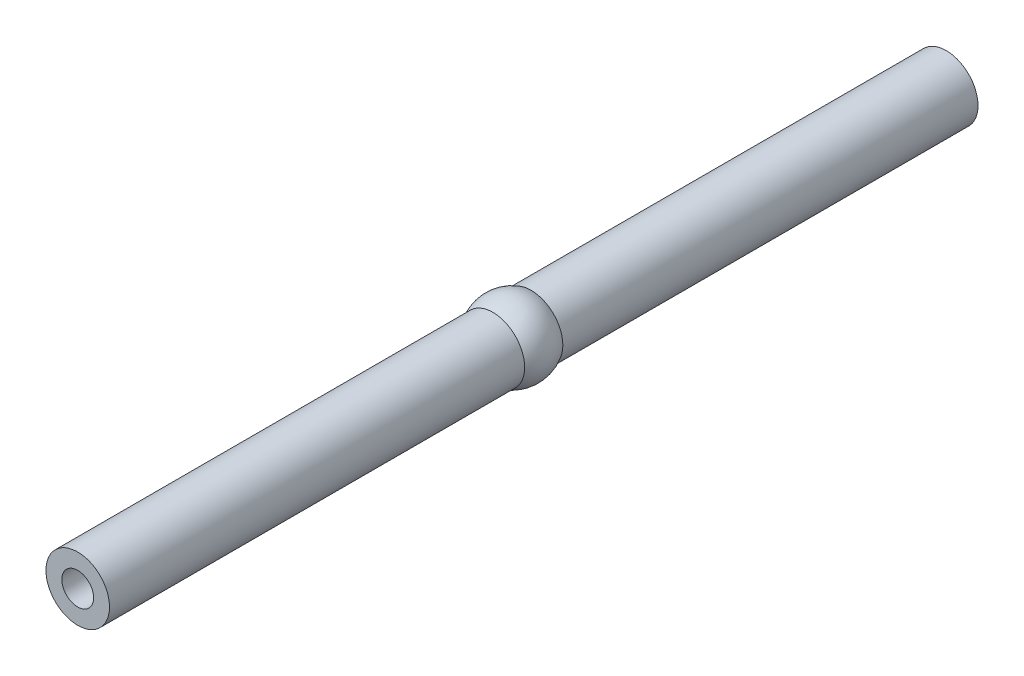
ISO-10303-21;
HEADER;
FILE_DESCRIPTION(('STEP AP214'),'2;1');
FILE_NAME('part.step','',(''),(''),'','','');
FILE_SCHEMA(('AUTOMOTIVE_DESIGN { 1 0 10303 214 1 1 1 1 }'));
ENDSEC;
DATA;
#1=APPLICATION_CONTEXT('core data for automotive mechanical design processes');
#2=APPLICATION_PROTOCOL_DEFINITION('international standard','automotive_design',2000,#1);
#3=PRODUCT_CONTEXT('',#1,'mechanical');
#4=PRODUCT('Part','Part','',(#3));
#5=PRODUCT_RELATED_PRODUCT_CATEGORY('part','',(#4));
#6=PRODUCT_DEFINITION_FORMATION('','',#4);
#7=PRODUCT_DEFINITION_CONTEXT('part definition',#1,'design');
#8=PRODUCT_DEFINITION('design','',#6,#7);
#9=PRODUCT_DEFINITION_SHAPE('','',#8);
#10=(LENGTH_UNIT() NAMED_UNIT(*) SI_UNIT(.MILLI.,.METRE.));
#11=(NAMED_UNIT(*) PLANE_ANGLE_UNIT() SI_UNIT($,.RADIAN.));
#12=(NAMED_UNIT(*) SI_UNIT($,.STERADIAN.) SOLID_ANGLE_UNIT());
#13=UNCERTAINTY_MEASURE_WITH_UNIT(LENGTH_MEASURE(1.E-05),#10,'distance_accuracy_value','');
#14=(GEOMETRIC_REPRESENTATION_CONTEXT(3) GLOBAL_UNCERTAINTY_ASSIGNED_CONTEXT((#13)) GLOBAL_UNIT_ASSIGNED_CONTEXT((#10,
#11,#12)) REPRESENTATION_CONTEXT('',''));
#15=CARTESIAN_POINT('',(0.,0.,0.));
#16=DIRECTION('',(0.,0.,1.));
#17=DIRECTION('',(1.,0.,0.));
#18=AXIS2_PLACEMENT_3D('',#15,#16,#17);
#19=CARTESIAN_POINT('',(0.,0.,41.));
#20=DIRECTION('',(0.,0.,-1.));
#21=DIRECTION('',(-1.,0.,0.));
#22=AXIS2_PLACEMENT_3D('',#19,#20,#21);
#23=CYLINDRICAL_SURFACE('',#22,3.);
#24=CARTESIAN_POINT('',(0.,0.,-1.802775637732));
#25=DIRECTION('',(0.,0.,1.));
#26=DIRECTION('',(1.,0.,0.));
#27=AXIS2_PLACEMENT_3D('',#24,#25,#26);
#28=CIRCLE('',#27,3.);
#29=CARTESIAN_POINT('',(3.,0.,-1.802775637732));
#30=VERTEX_POINT('',#29);
#31=EDGE_CURVE('E35',#30,#30,#28,.F.);
#32=ORIENTED_EDGE('',*,*,#31,.T.);
#33=EDGE_LOOP('',(#32));
#34=FACE_BOUND('',#33,.T.);
#35=CARTESIAN_POINT('',(0.,0.,-41.));
#36=DIRECTION('',(0.,0.,1.));
#37=DIRECTION('',(1.,0.,0.));
#38=AXIS2_PLACEMENT_3D('',#35,#36,#37);
#39=CIRCLE('',#38,3.);
#40=CARTESIAN_POINT('',(3.,0.,-41.));
#41=VERTEX_POINT('',#40);
#42=EDGE_CURVE('E39',#41,#41,#39,.T.);
#43=ORIENTED_EDGE('',*,*,#42,.T.);
#44=EDGE_LOOP('',(#43));
#45=FACE_BOUND('',#44,.T.);
#46=ADVANCED_FACE('F31',(#34,#45),#23,.T.);
#47=CARTESIAN_POINT('',(0.,0.,-41.));
#48=DIRECTION('',(0.,0.,1.));
#49=DIRECTION('',(1.,0.,0.));
#50=AXIS2_PLACEMENT_3D('',#47,#48,#49);
#51=PLANE('',#50);
#52=ORIENTED_EDGE('',*,*,#42,.F.);
#53=EDGE_LOOP('',(#52));
#54=FACE_BOUND('',#53,.T.);
#55=CARTESIAN_POINT('',(0.,0.,-41.));
#56=DIRECTION('',(0.,0.,1.));
#57=DIRECTION('',(1.,0.,0.));
#58=AXIS2_PLACEMENT_3D('',#55,#56,#57);
#59=CIRCLE('',#58,1.5);
#60=CARTESIAN_POINT('',(1.5,0.,-41.));
#61=VERTEX_POINT('',#60);
#62=EDGE_CURVE('E52',#61,#61,#59,.T.);
#63=ORIENTED_EDGE('',*,*,#62,.T.);
#64=EDGE_LOOP('',(#63));
#65=FACE_BOUND('',#64,.T.);
#66=ADVANCED_FACE('F83',(#54,#65),#51,.F.);
#67=CARTESIAN_POINT('',(0.,0.,-31.));
#68=DIRECTION('',(0.,0.,-1.));
#69=DIRECTION('',(-1.,0.,0.));
#70=AXIS2_PLACEMENT_3D('',#67,#68,#69);
#71=CYLINDRICAL_SURFACE('',#70,1.5);
#72=CARTESIAN_POINT('',(0.,0.,-31.));
#73=DIRECTION('',(0.,0.,1.));
#74=DIRECTION('',(1.,0.,0.));
#75=AXIS2_PLACEMENT_3D('',#72,#73,#74);
#76=CIRCLE('',#75,1.5);
#77=CARTESIAN_POINT('',(1.5,0.,-31.));
#78=VERTEX_POINT('',#77);
#79=EDGE_CURVE('E56',#78,#78,#76,.T.);
#80=ORIENTED_EDGE('',*,*,#79,.T.);
#81=EDGE_LOOP('',(#80));
#82=FACE_BOUND('',#81,.T.);
#83=ORIENTED_EDGE('',*,*,#62,.F.);
#84=EDGE_LOOP('',(#83));
#85=FACE_BOUND('',#84,.T.);
#86=ADVANCED_FACE('F87',(#82,#85),#71,.F.);
#87=CARTESIAN_POINT('',(0.,0.,-31.));
#88=DIRECTION('',(0.,0.,-1.));
#89=DIRECTION('',(1.,0.,0.));
#90=AXIS2_PLACEMENT_3D('',#87,#88,#89);
#91=PLANE('',#90);
#92=ORIENTED_EDGE('',*,*,#79,.F.);
#93=EDGE_LOOP('',(#92));
#94=FACE_BOUND('',#93,.T.);
#95=ADVANCED_FACE('F94',(#94),#91,.T.);
#96=CARTESIAN_POINT('',(0.,0.,0.));
#97=DIRECTION('',(0.,0.,-1.));
#98=DIRECTION('',(1.,0.,0.));
#99=AXIS2_PLACEMENT_3D('',#96,#97,#98);
#100=SPHERICAL_SURFACE('',#99,3.5);
#101=CARTESIAN_POINT('',(0.,0.,1.802775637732));
#102=DIRECTION('',(0.,0.,-1.));
#103=DIRECTION('',(-1.,0.,0.));
#104=AXIS2_PLACEMENT_3D('',#101,#102,#103);
#105=CIRCLE('',#104,3.);
#106=CARTESIAN_POINT('',(3.,0.,1.802775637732));
#107=VERTEX_POINT('',#106);
#108=EDGE_CURVE('E47',#107,#107,#105,.F.);
#109=CARTESIAN_POINT('',(3.,0.,1.802775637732));
#110=CARTESIAN_POINT('',(3.02032276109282,0.,1.76895705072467));
#111=CARTESIAN_POINT('',(3.0400731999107,0.,1.73479455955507));
#112=CARTESIAN_POINT('',(3.0784078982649,0.,1.66582142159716));
#113=CARTESIAN_POINT('',(3.09699215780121,0.,1.63101077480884));
#114=CARTESIAN_POINT('',(3.13297296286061,0.,1.56078097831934));
#115=CARTESIAN_POINT('',(3.1503695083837,0.,1.52536182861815));
#116=CARTESIAN_POINT('',(3.18395506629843,0.,1.45395557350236));
#117=CARTESIAN_POINT('',(3.20014407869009,0.,1.41796846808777));
#118=CARTESIAN_POINT('',(3.23129603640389,0.,1.34546744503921));
#119=CARTESIAN_POINT('',(3.24625898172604,0.,1.30895352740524));
#120=CARTESIAN_POINT('',(3.27494169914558,0.,1.2354406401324));
#121=CARTESIAN_POINT('',(3.28866147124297,0.,1.19844167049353));
#122=CARTESIAN_POINT('',(3.31484215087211,0.,1.12400099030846));
#123=CARTESIAN_POINT('',(3.32730305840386,0.,1.08655927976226));
#124=CARTESIAN_POINT('',(3.35095175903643,0.,1.01127593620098));
#125=CARTESIAN_POINT('',(3.36213955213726,0.,0.973434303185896));
#126=CARTESIAN_POINT('',(3.38322922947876,0.,0.897394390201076));
#127=CARTESIAN_POINT('',(3.39313111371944,0.,0.859196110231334));
#128=CARTESIAN_POINT('',(3.41163764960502,0.,0.782486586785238));
#129=CARTESIAN_POINT('',(3.42024230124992,0.,0.743975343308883));
#130=CARTESIAN_POINT('',(3.43614453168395,0.,0.666683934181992));
#131=CARTESIAN_POINT('',(3.44344211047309,0.,0.627903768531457));
#132=CARTESIAN_POINT('',(3.45672184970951,0.,0.550118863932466));
#133=CARTESIAN_POINT('',(3.4627040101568,0.,0.511114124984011));
#134=CARTESIAN_POINT('',(3.47334607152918,0.,0.432924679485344));
#135=CARTESIAN_POINT('',(3.47800597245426,0.,0.393739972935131));
#136=CARTESIAN_POINT('',(3.48599818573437,0.,0.315235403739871));
#137=CARTESIAN_POINT('',(3.48933049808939,0.,0.275915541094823));
#138=CARTESIAN_POINT('',(3.49466372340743,0.,0.197185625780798));
#139=CARTESIAN_POINT('',(3.49666463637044,0.,0.157775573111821));
#140=CARTESIAN_POINT('',(3.49933277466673,0.,0.078910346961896));
#141=CARTESIAN_POINT('',(3.5,0.,0.039455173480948));
#142=CARTESIAN_POINT('',(3.5,0.,-0.039455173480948));
#143=CARTESIAN_POINT('',(3.49933277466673,0.,-0.078910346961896));
#144=CARTESIAN_POINT('',(3.49666463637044,0.,-0.157775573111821));
#145=CARTESIAN_POINT('',(3.49466372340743,0.,-0.197185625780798));
#146=CARTESIAN_POINT('',(3.48933049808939,0.,-0.275915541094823));
#147=CARTESIAN_POINT('',(3.48599818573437,0.,-0.315235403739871));
#148=CARTESIAN_POINT('',(3.47800597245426,0.,-0.393739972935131));
#149=CARTESIAN_POINT('',(3.47334607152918,0.,-0.432924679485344));
#150=CARTESIAN_POINT('',(3.4627040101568,0.,-0.511114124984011));
#151=CARTESIAN_POINT('',(3.45672184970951,0.,-0.550118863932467));
#152=CARTESIAN_POINT('',(3.44344211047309,0.,-0.627903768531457));
#153=CARTESIAN_POINT('',(3.43614453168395,0.,-0.666683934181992));
#154=CARTESIAN_POINT('',(3.42024230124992,0.,-0.743975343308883));
#155=CARTESIAN_POINT('',(3.41163764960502,0.,-0.782486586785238));
#156=CARTESIAN_POINT('',(3.39313111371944,0.,-0.859196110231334));
#157=CARTESIAN_POINT('',(3.38322922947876,0.,-0.897394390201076));
#158=CARTESIAN_POINT('',(3.36213955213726,0.,-0.973434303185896));
#159=CARTESIAN_POINT('',(3.35095175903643,0.,-1.01127593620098));
#160=CARTESIAN_POINT('',(3.32730305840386,0.,-1.08655927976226));
#161=CARTESIAN_POINT('',(3.31484215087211,0.,-1.12400099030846));
#162=CARTESIAN_POINT('',(3.28866147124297,0.,-1.19844167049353));
#163=CARTESIAN_POINT('',(3.27494169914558,0.,-1.2354406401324));
#164=CARTESIAN_POINT('',(3.24625898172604,0.,-1.30895352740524));
#165=CARTESIAN_POINT('',(3.23129603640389,0.,-1.34546744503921));
#166=CARTESIAN_POINT('',(3.20014407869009,0.,-1.41796846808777));
#167=CARTESIAN_POINT('',(3.18395506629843,0.,-1.45395557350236));
#168=CARTESIAN_POINT('',(3.1503695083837,0.,-1.52536182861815));
#169=CARTESIAN_POINT('',(3.13297296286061,0.,-1.56078097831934));
#170=CARTESIAN_POINT('',(3.09699215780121,0.,-1.63101077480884));
#171=CARTESIAN_POINT('',(3.0784078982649,0.,-1.66582142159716));
#172=CARTESIAN_POINT('',(3.0400731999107,0.,-1.73479455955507));
#173=CARTESIAN_POINT('',(3.02032276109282,0.,-1.76895705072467));
#174=CARTESIAN_POINT('',(3.,0.,-1.802775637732));
#175=B_SPLINE_CURVE_WITH_KNOTS('',3,(#109,#110,#111,#112,#113,#114,#115,#116,#117,#118,#119,
#120,#121,#122,#123,#124,#125,#126,#127,#128,#129,#130,#131,#132,#133,#134,#135,#136,#137,#138,
#139,#140,#141,#142,#143,#144,#145,#146,#147,#148,#149,#150,#151,#152,#153,#154,#155,#156,#157,
#158,#159,#160,#161,#162,#163,#164,#165,#166,#167,#168,#169,#170,#171,#172,#173,#174),
.UNSPECIFIED.,.F.,.F.,(4,2,2,2,2,2,2,2,2,2,2,2,2,2,2,2,2,2,2,2,2,2,2,2,2,2,2,2,2,2,2,2,4),(0.,
0.118359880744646,0.236719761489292,0.355079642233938,0.473439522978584,0.59179940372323,
0.710159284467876,0.828519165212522,0.946879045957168,1.06523892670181,1.18359880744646,
1.30195868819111,1.42031856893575,1.5386784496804,1.65703833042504,1.77539821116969,
1.89375809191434,2.01211797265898,2.13047785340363,2.24883773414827,2.36719761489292,
2.48555749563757,2.60391737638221,2.72227725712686,2.8406371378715,2.95899701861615,
3.0773568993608,3.19571678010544,3.31407666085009,3.43243654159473,3.55079642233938,
3.66915630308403,3.78751618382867),.UNSPECIFIED.);
#176=EDGE_CURVE('BSEAM99',#107,#30,#175,.T.);
#177=ORIENTED_EDGE('',*,*,#108,.F.);
#178=ORIENTED_EDGE('',*,*,#31,.F.);
#179=ORIENTED_EDGE('',*,*,#176,.T.);
#180=ORIENTED_EDGE('',*,*,#176,.F.);
#181=EDGE_LOOP('',(#177,#179,#178,#180));
#182=FACE_BOUND('',#181,.T.);
#183=ADVANCED_FACE('F99',(#182),#100,.T.);
#184=CARTESIAN_POINT('',(0.,0.,31.));
#185=DIRECTION('',(0.,0.,1.));
#186=DIRECTION('',(1.,0.,0.));
#187=AXIS2_PLACEMENT_3D('',#184,#185,#186);
#188=PLANE('',#187);
#189=CARTESIAN_POINT('',(0.,0.,31.));
#190=DIRECTION('',(0.,0.,1.));
#191=DIRECTION('',(1.,0.,0.));
#192=AXIS2_PLACEMENT_3D('',#189,#190,#191);
#193=CIRCLE('',#192,1.5);
#194=CARTESIAN_POINT('',(1.5,0.,31.));
#195=VERTEX_POINT('',#194);
#196=EDGE_CURVE('E44',#195,#195,#193,.T.);
#197=ORIENTED_EDGE('',*,*,#196,.T.);
#198=EDGE_LOOP('',(#197));
#199=FACE_BOUND('',#198,.T.);
#200=ADVANCED_FACE('F68',(#199),#188,.T.);
#201=CARTESIAN_POINT('',(0.,0.,31.));
#202=DIRECTION('',(0.,0.,1.));
#203=DIRECTION('',(1.,0.,0.));
#204=AXIS2_PLACEMENT_3D('',#201,#202,#203);
#205=CYLINDRICAL_SURFACE('',#204,1.5);
#206=ORIENTED_EDGE('',*,*,#196,.F.);
#207=EDGE_LOOP('',(#206));
#208=FACE_BOUND('',#207,.T.);
#209=CARTESIAN_POINT('',(0.,0.,41.));
#210=DIRECTION('',(0.,0.,1.));
#211=DIRECTION('',(1.,0.,0.));
#212=AXIS2_PLACEMENT_3D('',#209,#210,#211);
#213=CIRCLE('',#212,1.5);
#214=CARTESIAN_POINT('',(1.5,0.,41.));
#215=VERTEX_POINT('',#214);
#216=EDGE_CURVE('E61',#215,#215,#213,.T.);
#217=ORIENTED_EDGE('',*,*,#216,.T.);
#218=EDGE_LOOP('',(#217));
#219=FACE_BOUND('',#218,.T.);
#220=ADVANCED_FACE('F70',(#208,#219),#205,.F.);
#221=CARTESIAN_POINT('',(0.,0.,41.));
#222=DIRECTION('',(0.,0.,1.));
#223=DIRECTION('',(1.,0.,0.));
#224=AXIS2_PLACEMENT_3D('',#221,#222,#223);
#225=PLANE('',#224);
#226=ORIENTED_EDGE('',*,*,#216,.F.);
#227=EDGE_LOOP('',(#226));
#228=FACE_BOUND('',#227,.T.);
#229=CARTESIAN_POINT('',(0.,0.,41.));
#230=DIRECTION('',(0.,0.,1.));
#231=DIRECTION('',(1.,0.,0.));
#232=AXIS2_PLACEMENT_3D('',#229,#230,#231);
#233=CIRCLE('',#232,3.);
#234=CARTESIAN_POINT('',(3.,0.,41.));
#235=VERTEX_POINT('',#234);
#236=EDGE_CURVE('E10',#235,#235,#233,.T.);
#237=ORIENTED_EDGE('',*,*,#236,.T.);
#238=EDGE_LOOP('',(#237));
#239=FACE_BOUND('',#238,.T.);
#240=ADVANCED_FACE('F73',(#228,#239),#225,.T.);
#241=ORIENTED_EDGE('',*,*,#108,.T.);
#242=EDGE_LOOP('',(#241));
#243=FACE_BOUND('',#242,.T.);
#244=ORIENTED_EDGE('',*,*,#236,.F.);
#245=EDGE_LOOP('',(#244));
#246=FACE_BOUND('',#245,.T.);
#247=ADVANCED_FACE('F33',(#243,#246),#23,.T.);
#248=CLOSED_SHELL('',(#46,#66,#86,#95,#183,#200,#220,#240,#247));
#249=MANIFOLD_SOLID_BREP('B2',#248);
#250=ADVANCED_BREP_SHAPE_REPRESENTATION('',(#18,#249),#14);
#251=SHAPE_DEFINITION_REPRESENTATION(#9,#250);
ENDSEC;
END-ISO-10303-21;
